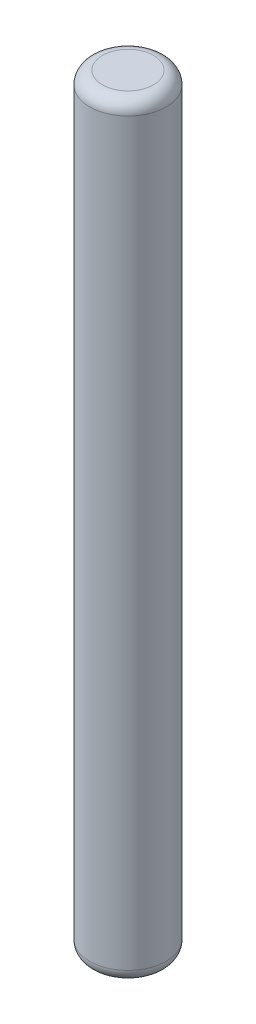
from build123d import *

# Parameters (mm, degrees)
SKETCH_1_R      = 0.75
EXTRUDE_1_DEPTH = 7.5
FILLET_1_R      = 0.25


with BuildPart() as part:
    # Sketch 1 → Extrude 1 (new, symmetric)
    with BuildSketch(Plane(origin=(0, 0, 0), x_dir=(1, 0, 0), z_dir=(0, 1, 0))):
        with Locations(Location((0, 0, 0), (0, 0, 270))):
            Circle(SKETCH_1_R)
    extrude(amount=EXTRUDE_1_DEPTH, both=True)

    # Fillet 1
    fillet_1_edges = [part.edges().sort_by_distance(p)[0] for p in [
        (0, -7.5, -0.75),
        (0, 7.5, -0.75),
    ]]
    fillet(fillet_1_edges, radius=FILLET_1_R)


solid = part.part
